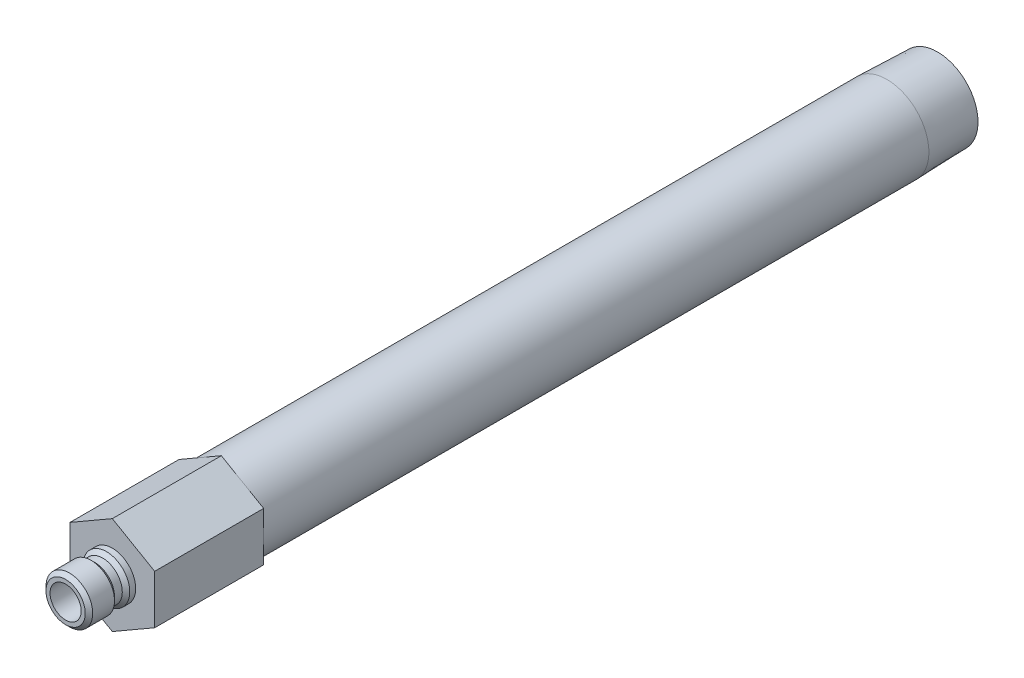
ISO-10303-21;
HEADER;
FILE_DESCRIPTION(('STEP AP214'),'2;1');
FILE_NAME('part.step','',(''),(''),'','','');
FILE_SCHEMA(('AUTOMOTIVE_DESIGN { 1 0 10303 214 1 1 1 1 }'));
ENDSEC;
DATA;
#1=APPLICATION_CONTEXT('core data for automotive mechanical design processes');
#2=APPLICATION_PROTOCOL_DEFINITION('international standard','automotive_design',2000,#1);
#3=PRODUCT_CONTEXT('',#1,'mechanical');
#4=PRODUCT('Part','Part','',(#3));
#5=PRODUCT_RELATED_PRODUCT_CATEGORY('part','',(#4));
#6=PRODUCT_DEFINITION_FORMATION('','',#4);
#7=PRODUCT_DEFINITION_CONTEXT('part definition',#1,'design');
#8=PRODUCT_DEFINITION('design','',#6,#7);
#9=PRODUCT_DEFINITION_SHAPE('','',#8);
#10=(LENGTH_UNIT() NAMED_UNIT(*) SI_UNIT(.MILLI.,.METRE.));
#11=(NAMED_UNIT(*) PLANE_ANGLE_UNIT() SI_UNIT($,.RADIAN.));
#12=(NAMED_UNIT(*) SI_UNIT($,.STERADIAN.) SOLID_ANGLE_UNIT());
#13=UNCERTAINTY_MEASURE_WITH_UNIT(LENGTH_MEASURE(1.E-05),#10,'distance_accuracy_value','');
#14=(GEOMETRIC_REPRESENTATION_CONTEXT(3) GLOBAL_UNCERTAINTY_ASSIGNED_CONTEXT((#13)) GLOBAL_UNIT_ASSIGNED_CONTEXT((#10,
#11,#12)) REPRESENTATION_CONTEXT('',''));
#15=CARTESIAN_POINT('',(0.,0.,0.));
#16=DIRECTION('',(0.,0.,1.));
#17=DIRECTION('',(1.,0.,0.));
#18=AXIS2_PLACEMENT_3D('',#15,#16,#17);
#19=CARTESIAN_POINT('',(0.,0.,0.));
#20=DIRECTION('',(0.,0.,-1.));
#21=DIRECTION('',(0.,1.,0.));
#22=AXIS2_PLACEMENT_3D('',#19,#20,#21);
#23=CYLINDRICAL_SURFACE('',#22,8.57249999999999);
#24=CARTESIAN_POINT('',(0.,0.,-157.9372));
#25=DIRECTION('',(0.,0.,-1.));
#26=DIRECTION('',(0.,1.,0.));
#27=AXIS2_PLACEMENT_3D('',#24,#25,#26);
#28=CIRCLE('',#27,8.57249999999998);
#29=CARTESIAN_POINT('',(0.,8.5725,-157.9372));
#30=VERTEX_POINT('',#29);
#31=EDGE_CURVE('E168',#30,#30,#28,.T.);
#32=ORIENTED_EDGE('',*,*,#31,.F.);
#33=EDGE_LOOP('',(#32));
#34=FACE_BOUND('',#33,.T.);
#35=CARTESIAN_POINT('',(0.,0.,-22.225));
#36=DIRECTION('',(0.,0.,1.));
#37=DIRECTION('',(1.,0.,0.));
#38=AXIS2_PLACEMENT_3D('',#35,#36,#37);
#39=CIRCLE('',#38,8.57249999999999);
#40=CARTESIAN_POINT('',(8.57249999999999,0.,-22.225));
#41=VERTEX_POINT('',#40);
#42=EDGE_CURVE('E37',#41,#41,#39,.F.);
#43=ORIENTED_EDGE('',*,*,#42,.T.);
#44=EDGE_LOOP('',(#43));
#45=FACE_BOUND('',#44,.T.);
#46=ADVANCED_FACE('F33',(#34,#45),#23,.T.);
#47=CARTESIAN_POINT('',(0.,0.,0.));
#48=DIRECTION('',(0.,0.,-1.));
#49=DIRECTION('',(0.,1.,0.));
#50=AXIS2_PLACEMENT_3D('',#47,#48,#49);
#51=CYLINDRICAL_SURFACE('',#50,3.175);
#52=CARTESIAN_POINT('',(0.,0.,9.525));
#53=DIRECTION('',(0.,0.,-1.));
#54=DIRECTION('',(0.,1.,0.));
#55=AXIS2_PLACEMENT_3D('',#52,#53,#54);
#56=CIRCLE('',#55,3.175);
#57=CARTESIAN_POINT('',(0.,3.175,9.525));
#58=VERTEX_POINT('',#57);
#59=EDGE_CURVE('E144',#58,#58,#56,.T.);
#60=ORIENTED_EDGE('',*,*,#59,.F.);
#61=EDGE_LOOP('',(#60));
#62=FACE_BOUND('',#61,.T.);
#63=CARTESIAN_POINT('',(0.,0.,-22.225));
#64=DIRECTION('',(0.,0.,-1.));
#65=DIRECTION('',(0.,1.,0.));
#66=AXIS2_PLACEMENT_3D('',#63,#64,#65);
#67=CIRCLE('',#66,3.17499999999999);
#68=CARTESIAN_POINT('',(0.,3.175,-22.225));
#69=VERTEX_POINT('',#68);
#70=EDGE_CURVE('E11',#69,#69,#67,.T.);
#71=ORIENTED_EDGE('',*,*,#70,.T.);
#72=EDGE_LOOP('',(#71));
#73=FACE_BOUND('',#72,.T.);
#74=ADVANCED_FACE('F35',(#62,#73),#51,.F.);
#75=CARTESIAN_POINT('',(0.,3.175,-22.225));
#76=DIRECTION('',(0.,0.,-1.));
#77=DIRECTION('',(0.,1.,0.));
#78=AXIS2_PLACEMENT_3D('',#75,#76,#77);
#79=PLANE('',#78);
#80=CARTESIAN_POINT('',(0.,0.,-22.225));
#81=DIRECTION('',(0.,0.,-1.));
#82=DIRECTION('',(0.,1.,0.));
#83=AXIS2_PLACEMENT_3D('',#80,#81,#82);
#84=CIRCLE('',#83,6.2611);
#85=CARTESIAN_POINT('',(0.,6.2611,-22.225));
#86=VERTEX_POINT('',#85);
#87=EDGE_CURVE('E43',#86,#86,#84,.T.);
#88=ORIENTED_EDGE('',*,*,#87,.T.);
#89=EDGE_LOOP('',(#88));
#90=FACE_BOUND('',#89,.T.);
#91=ORIENTED_EDGE('',*,*,#70,.F.);
#92=EDGE_LOOP('',(#91));
#93=FACE_BOUND('',#92,.T.);
#94=ADVANCED_FACE('F180',(#90,#93),#79,.T.);
#95=CARTESIAN_POINT('',(0.,0.,0.));
#96=DIRECTION('',(0.,0.,-1.));
#97=DIRECTION('',(0.,1.,0.));
#98=AXIS2_PLACEMENT_3D('',#95,#96,#97);
#99=CYLINDRICAL_SURFACE('',#98,6.26109999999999);
#100=CARTESIAN_POINT('',(0.,0.,-168.275));
#101=DIRECTION('',(0.,0.,-1.));
#102=DIRECTION('',(0.,1.,0.));
#103=AXIS2_PLACEMENT_3D('',#100,#101,#102);
#104=CIRCLE('',#103,6.26109999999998);
#105=CARTESIAN_POINT('',(0.,6.2611,-168.275));
#106=VERTEX_POINT('',#105);
#107=EDGE_CURVE('E174',#106,#106,#104,.T.);
#108=ORIENTED_EDGE('',*,*,#107,.T.);
#109=EDGE_LOOP('',(#108));
#110=FACE_BOUND('',#109,.T.);
#111=ORIENTED_EDGE('',*,*,#87,.F.);
#112=EDGE_LOOP('',(#111));
#113=FACE_BOUND('',#112,.T.);
#114=ADVANCED_FACE('F183',(#110,#113),#99,.F.);
#115=CARTESIAN_POINT('',(0.,8.24944566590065,-168.275));
#116=DIRECTION('',(0.,0.,-1.));
#117=DIRECTION('',(0.,1.,0.));
#118=AXIS2_PLACEMENT_3D('',#115,#116,#117);
#119=PLANE('',#118);
#120=CARTESIAN_POINT('',(0.,0.,-168.275));
#121=DIRECTION('',(0.,0.,-1.));
#122=DIRECTION('',(0.,1.,0.));
#123=AXIS2_PLACEMENT_3D('',#120,#121,#122);
#124=CIRCLE('',#123,8.24944566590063);
#125=CARTESIAN_POINT('',(0.,8.24944566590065,-168.275));
#126=VERTEX_POINT('',#125);
#127=EDGE_CURVE('E171',#126,#126,#124,.T.);
#128=ORIENTED_EDGE('',*,*,#127,.T.);
#129=EDGE_LOOP('',(#128));
#130=FACE_BOUND('',#129,.T.);
#131=ORIENTED_EDGE('',*,*,#107,.F.);
#132=EDGE_LOOP('',(#131));
#133=FACE_BOUND('',#132,.T.);
#134=ADVANCED_FACE('F185',(#130,#133),#119,.T.);
#135=CARTESIAN_POINT('',(0.,0.,-168.275));
#136=DIRECTION('',(0.,0.,1.));
#137=DIRECTION('',(0.,-1.,0.));
#138=AXIS2_PLACEMENT_3D('',#135,#136,#137);
#139=CONICAL_SURFACE('',#138,8.24944566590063,0.0312396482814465);
#140=ORIENTED_EDGE('',*,*,#31,.T.);
#141=EDGE_LOOP('',(#140));
#142=FACE_BOUND('',#141,.T.);
#143=ORIENTED_EDGE('',*,*,#127,.F.);
#144=EDGE_LOOP('',(#143));
#145=FACE_BOUND('',#144,.T.);
#146=ADVANCED_FACE('F192',(#142,#145),#139,.T.);
#147=CARTESIAN_POINT('',(0.,4.7625,0.));
#148=DIRECTION('',(0.,0.,1.));
#149=DIRECTION('',(0.,-1.,0.));
#150=AXIS2_PLACEMENT_3D('',#147,#148,#149);
#151=PLANE('',#150);
#152=CARTESIAN_POINT('',(0.,0.,0.));
#153=DIRECTION('',(0.,0.,-1.));
#154=DIRECTION('',(0.,1.,0.));
#155=AXIS2_PLACEMENT_3D('',#152,#153,#154);
#156=CIRCLE('',#155,4.7625);
#157=CARTESIAN_POINT('',(0.,4.7625,0.));
#158=VERTEX_POINT('',#157);
#159=EDGE_CURVE('E165',#158,#158,#156,.T.);
#160=ORIENTED_EDGE('',*,*,#159,.T.);
#161=EDGE_LOOP('',(#160));
#162=FACE_BOUND('',#161,.T.);
#163=DIRECTION('',(-0.866025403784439,-0.5,0.));
#164=VECTOR('',#163,1.);
#165=CARTESIAN_POINT('',(0.,9.97199384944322,0.));
#166=LINE('',#165,#164);
#167=CARTESIAN_POINT('',(0.,9.97199384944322,0.));
#168=VERTEX_POINT('',#167);
#169=CARTESIAN_POINT('',(-8.636,4.98599692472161,0.));
#170=VERTEX_POINT('',#169);
#171=EDGE_CURVE('E122',#168,#170,#166,.T.);
#172=ORIENTED_EDGE('',*,*,#171,.T.);
#173=DIRECTION('',(0.,-1.,0.));
#174=VECTOR('',#173,1.);
#175=CARTESIAN_POINT('',(-8.636,4.98599692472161,0.));
#176=LINE('',#175,#174);
#177=CARTESIAN_POINT('',(-8.636,-4.98599692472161,0.));
#178=VERTEX_POINT('',#177);
#179=EDGE_CURVE('E125',#170,#178,#176,.T.);
#180=ORIENTED_EDGE('',*,*,#179,.T.);
#181=DIRECTION('',(0.866025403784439,-0.5,0.));
#182=VECTOR('',#181,1.);
#183=CARTESIAN_POINT('',(-8.636,-4.98599692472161,0.));
#184=LINE('',#183,#182);
#185=CARTESIAN_POINT('',(0.,-9.97199384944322,0.));
#186=VERTEX_POINT('',#185);
#187=EDGE_CURVE('E128',#178,#186,#184,.T.);
#188=ORIENTED_EDGE('',*,*,#187,.T.);
#189=DIRECTION('',(0.866025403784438,0.5,0.));
#190=VECTOR('',#189,1.);
#191=CARTESIAN_POINT('',(0.,-9.97199384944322,0.));
#192=LINE('',#191,#190);
#193=CARTESIAN_POINT('',(8.636,-4.98599692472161,0.));
#194=VERTEX_POINT('',#193);
#195=EDGE_CURVE('E131',#186,#194,#192,.T.);
#196=ORIENTED_EDGE('',*,*,#195,.T.);
#197=DIRECTION('',(0.,1.,0.));
#198=VECTOR('',#197,1.);
#199=CARTESIAN_POINT('',(8.636,-4.98599692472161,0.));
#200=LINE('',#199,#198);
#201=CARTESIAN_POINT('',(8.636,4.98599692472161,0.));
#202=VERTEX_POINT('',#201);
#203=EDGE_CURVE('E99',#194,#202,#200,.T.);
#204=ORIENTED_EDGE('',*,*,#203,.T.);
#205=DIRECTION('',(-0.866025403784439,0.5,0.));
#206=VECTOR('',#205,1.);
#207=CARTESIAN_POINT('',(8.636,4.98599692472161,0.));
#208=LINE('',#207,#206);
#209=EDGE_CURVE('E134',#202,#168,#208,.T.);
#210=ORIENTED_EDGE('',*,*,#209,.T.);
#211=EDGE_LOOP('',(#172,#180,#188,#196,#204,#210));
#212=FACE_BOUND('',#211,.T.);
#213=ADVANCED_FACE('F206',(#162,#212),#151,.T.);
#214=CARTESIAN_POINT('',(0.,0.,0.));
#215=DIRECTION('',(0.,0.,-1.));
#216=DIRECTION('',(0.,1.,0.));
#217=AXIS2_PLACEMENT_3D('',#214,#215,#216);
#218=CYLINDRICAL_SURFACE('',#217,4.7625);
#219=CARTESIAN_POINT('',(0.,0.,1.2065));
#220=DIRECTION('',(0.,0.,-1.));
#221=DIRECTION('',(0.,1.,0.));
#222=AXIS2_PLACEMENT_3D('',#219,#220,#221);
#223=CIRCLE('',#222,4.7625);
#224=CARTESIAN_POINT('',(0.,4.7625,1.2065));
#225=VERTEX_POINT('',#224);
#226=EDGE_CURVE('E162',#225,#225,#223,.T.);
#227=ORIENTED_EDGE('',*,*,#226,.T.);
#228=EDGE_LOOP('',(#227));
#229=FACE_BOUND('',#228,.T.);
#230=ORIENTED_EDGE('',*,*,#159,.F.);
#231=EDGE_LOOP('',(#230));
#232=FACE_BOUND('',#231,.T.);
#233=ADVANCED_FACE('F213',(#229,#232),#218,.T.);
#234=CARTESIAN_POINT('',(0.,0.,1.2065));
#235=DIRECTION('',(0.,0.,-1.));
#236=DIRECTION('',(0.,1.,0.));
#237=AXIS2_PLACEMENT_3D('',#234,#235,#236);
#238=CONICAL_SURFACE('',#237,4.7625,0.785398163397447);
#239=CARTESIAN_POINT('',(0.,0.,1.9685));
#240=DIRECTION('',(0.,0.,-1.));
#241=DIRECTION('',(0.,1.,0.));
#242=AXIS2_PLACEMENT_3D('',#239,#240,#241);
#243=CIRCLE('',#242,4.0005);
#244=CARTESIAN_POINT('',(0.,4.0005,1.9685));
#245=VERTEX_POINT('',#244);
#246=EDGE_CURVE('E159',#245,#245,#243,.T.);
#247=ORIENTED_EDGE('',*,*,#246,.T.);
#248=EDGE_LOOP('',(#247));
#249=FACE_BOUND('',#248,.T.);
#250=ORIENTED_EDGE('',*,*,#226,.F.);
#251=EDGE_LOOP('',(#250));
#252=FACE_BOUND('',#251,.T.);
#253=ADVANCED_FACE('F222',(#249,#252),#238,.T.);
#254=CARTESIAN_POINT('',(0.,0.,0.));
#255=DIRECTION('',(0.,0.,-1.));
#256=DIRECTION('',(0.,1.,0.));
#257=AXIS2_PLACEMENT_3D('',#254,#255,#256);
#258=CYLINDRICAL_SURFACE('',#257,4.0005);
#259=CARTESIAN_POINT('',(0.,0.,3.556));
#260=DIRECTION('',(0.,0.,-1.));
#261=DIRECTION('',(0.,1.,0.));
#262=AXIS2_PLACEMENT_3D('',#259,#260,#261);
#263=CIRCLE('',#262,4.0005);
#264=CARTESIAN_POINT('',(0.,4.0005,3.556));
#265=VERTEX_POINT('',#264);
#266=EDGE_CURVE('E156',#265,#265,#263,.T.);
#267=ORIENTED_EDGE('',*,*,#266,.T.);
#268=EDGE_LOOP('',(#267));
#269=FACE_BOUND('',#268,.T.);
#270=ORIENTED_EDGE('',*,*,#246,.F.);
#271=EDGE_LOOP('',(#270));
#272=FACE_BOUND('',#271,.T.);
#273=ADVANCED_FACE('F263',(#269,#272),#258,.T.);
#274=CARTESIAN_POINT('',(0.,0.,3.556));
#275=DIRECTION('',(0.,0.,1.));
#276=DIRECTION('',(0.,-1.,0.));
#277=AXIS2_PLACEMENT_3D('',#274,#275,#276);
#278=CONICAL_SURFACE('',#277,4.0005,0.785398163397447);
#279=CARTESIAN_POINT('',(0.,0.,4.318));
#280=DIRECTION('',(0.,0.,-1.));
#281=DIRECTION('',(0.,1.,0.));
#282=AXIS2_PLACEMENT_3D('',#279,#280,#281);
#283=CIRCLE('',#282,4.7625);
#284=CARTESIAN_POINT('',(0.,4.7625,4.318));
#285=VERTEX_POINT('',#284);
#286=EDGE_CURVE('E153',#285,#285,#283,.T.);
#287=ORIENTED_EDGE('',*,*,#286,.T.);
#288=EDGE_LOOP('',(#287));
#289=FACE_BOUND('',#288,.T.);
#290=ORIENTED_EDGE('',*,*,#266,.F.);
#291=EDGE_LOOP('',(#290));
#292=FACE_BOUND('',#291,.T.);
#293=ADVANCED_FACE('F259',(#289,#292),#278,.T.);
#294=CARTESIAN_POINT('',(0.,0.,0.));
#295=DIRECTION('',(0.,0.,-1.));
#296=DIRECTION('',(0.,1.,0.));
#297=AXIS2_PLACEMENT_3D('',#294,#295,#296);
#298=CYLINDRICAL_SURFACE('',#297,4.7625);
#299=CARTESIAN_POINT('',(0.,0.,8.763));
#300=DIRECTION('',(0.,0.,-1.));
#301=DIRECTION('',(0.,1.,0.));
#302=AXIS2_PLACEMENT_3D('',#299,#300,#301);
#303=CIRCLE('',#302,4.7625);
#304=CARTESIAN_POINT('',(0.,4.7625,8.763));
#305=VERTEX_POINT('',#304);
#306=EDGE_CURVE('E150',#305,#305,#303,.T.);
#307=ORIENTED_EDGE('',*,*,#306,.T.);
#308=EDGE_LOOP('',(#307));
#309=FACE_BOUND('',#308,.T.);
#310=ORIENTED_EDGE('',*,*,#286,.F.);
#311=EDGE_LOOP('',(#310));
#312=FACE_BOUND('',#311,.T.);
#313=ADVANCED_FACE('F255',(#309,#312),#298,.T.);
#314=CARTESIAN_POINT('',(0.,0.,8.763));
#315=DIRECTION('',(0.,0.,-1.));
#316=DIRECTION('',(0.,1.,0.));
#317=AXIS2_PLACEMENT_3D('',#314,#315,#316);
#318=CONICAL_SURFACE('',#317,4.7625,0.785398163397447);
#319=CARTESIAN_POINT('',(0.,0.,9.525));
#320=DIRECTION('',(0.,0.,-1.));
#321=DIRECTION('',(0.,1.,0.));
#322=AXIS2_PLACEMENT_3D('',#319,#320,#321);
#323=CIRCLE('',#322,4.0005);
#324=CARTESIAN_POINT('',(0.,4.0005,9.525));
#325=VERTEX_POINT('',#324);
#326=EDGE_CURVE('E147',#325,#325,#323,.T.);
#327=ORIENTED_EDGE('',*,*,#326,.T.);
#328=EDGE_LOOP('',(#327));
#329=FACE_BOUND('',#328,.T.);
#330=ORIENTED_EDGE('',*,*,#306,.F.);
#331=EDGE_LOOP('',(#330));
#332=FACE_BOUND('',#331,.T.);
#333=ADVANCED_FACE('F251',(#329,#332),#318,.T.);
#334=CARTESIAN_POINT('',(0.,3.175,9.525));
#335=DIRECTION('',(0.,0.,1.));
#336=DIRECTION('',(0.,-1.,0.));
#337=AXIS2_PLACEMENT_3D('',#334,#335,#336);
#338=PLANE('',#337);
#339=ORIENTED_EDGE('',*,*,#59,.T.);
#340=EDGE_LOOP('',(#339));
#341=FACE_BOUND('',#340,.T.);
#342=ORIENTED_EDGE('',*,*,#326,.F.);
#343=EDGE_LOOP('',(#342));
#344=FACE_BOUND('',#343,.T.);
#345=ADVANCED_FACE('F239',(#341,#344),#338,.T.);
#346=CARTESIAN_POINT('',(0.,9.97199384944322,-22.225));
#347=DIRECTION('',(-0.5,0.866025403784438,0.));
#348=DIRECTION('',(-0.866025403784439,-0.5,0.));
#349=AXIS2_PLACEMENT_3D('',#346,#347,#348);
#350=PLANE('',#349);
#351=ORIENTED_EDGE('',*,*,#171,.F.);
#352=DIRECTION('',(0.,0.,1.));
#353=VECTOR('',#352,1.);
#354=CARTESIAN_POINT('',(0.,9.97199384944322,-22.225));
#355=LINE('',#354,#353);
#356=CARTESIAN_POINT('',(0.,9.97199384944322,-22.225));
#357=VERTEX_POINT('',#356);
#358=EDGE_CURVE('E51',#357,#168,#355,.T.);
#359=ORIENTED_EDGE('',*,*,#358,.F.);
#360=DIRECTION('',(-0.866025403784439,-0.5,0.));
#361=VECTOR('',#360,1.);
#362=CARTESIAN_POINT('',(0.,9.97199384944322,-22.225));
#363=LINE('',#362,#361);
#364=CARTESIAN_POINT('',(-8.636,4.98599692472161,-22.225));
#365=VERTEX_POINT('',#364);
#366=EDGE_CURVE('E137',#357,#365,#363,.T.);
#367=ORIENTED_EDGE('',*,*,#366,.T.);
#368=DIRECTION('',(0.,0.,1.));
#369=VECTOR('',#368,1.);
#370=CARTESIAN_POINT('',(-8.636,4.98599692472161,-22.225));
#371=LINE('',#370,#369);
#372=EDGE_CURVE('E86',#365,#170,#371,.T.);
#373=ORIENTED_EDGE('',*,*,#372,.T.);
#374=EDGE_LOOP('',(#351,#359,#367,#373));
#375=FACE_BOUND('',#374,.T.);
#376=ADVANCED_FACE('F226',(#375),#350,.T.);
#377=CARTESIAN_POINT('',(8.636,4.98599692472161,-22.225));
#378=DIRECTION('',(0.5,0.866025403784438,0.));
#379=DIRECTION('',(-0.866025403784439,0.5,0.));
#380=AXIS2_PLACEMENT_3D('',#377,#378,#379);
#381=PLANE('',#380);
#382=ORIENTED_EDGE('',*,*,#209,.F.);
#383=DIRECTION('',(0.,0.,1.));
#384=VECTOR('',#383,1.);
#385=CARTESIAN_POINT('',(8.636,4.98599692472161,-22.225));
#386=LINE('',#385,#384);
#387=CARTESIAN_POINT('',(8.636,4.98599692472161,-22.225));
#388=VERTEX_POINT('',#387);
#389=EDGE_CURVE('E74',#388,#202,#386,.T.);
#390=ORIENTED_EDGE('',*,*,#389,.F.);
#391=DIRECTION('',(-0.866025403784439,0.5,0.));
#392=VECTOR('',#391,1.);
#393=CARTESIAN_POINT('',(8.636,4.98599692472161,-22.225));
#394=LINE('',#393,#392);
#395=EDGE_CURVE('E112',#388,#357,#394,.T.);
#396=ORIENTED_EDGE('',*,*,#395,.T.);
#397=ORIENTED_EDGE('',*,*,#358,.T.);
#398=EDGE_LOOP('',(#382,#390,#396,#397));
#399=FACE_BOUND('',#398,.T.);
#400=ADVANCED_FACE('F231',(#399),#381,.T.);
#401=CARTESIAN_POINT('',(8.636,-4.98599692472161,-22.225));
#402=DIRECTION('',(1.,0.,0.));
#403=DIRECTION('',(0.,1.,0.));
#404=AXIS2_PLACEMENT_3D('',#401,#402,#403);
#405=PLANE('',#404);
#406=ORIENTED_EDGE('',*,*,#203,.F.);
#407=DIRECTION('',(0.,0.,1.));
#408=VECTOR('',#407,1.);
#409=CARTESIAN_POINT('',(8.636,-4.98599692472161,-22.225));
#410=LINE('',#409,#408);
#411=CARTESIAN_POINT('',(8.636,-4.98599692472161,-22.225));
#412=VERTEX_POINT('',#411);
#413=EDGE_CURVE('E94',#412,#194,#410,.T.);
#414=ORIENTED_EDGE('',*,*,#413,.F.);
#415=DIRECTION('',(0.,1.,0.));
#416=VECTOR('',#415,1.);
#417=CARTESIAN_POINT('',(8.636,-4.98599692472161,-22.225));
#418=LINE('',#417,#416);
#419=EDGE_CURVE('E97',#412,#388,#418,.T.);
#420=ORIENTED_EDGE('',*,*,#419,.T.);
#421=ORIENTED_EDGE('',*,*,#389,.T.);
#422=EDGE_LOOP('',(#406,#414,#420,#421));
#423=FACE_BOUND('',#422,.T.);
#424=ADVANCED_FACE('F96',(#423),#405,.T.);
#425=CARTESIAN_POINT('',(0.,-9.97199384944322,-22.225));
#426=DIRECTION('',(0.5,-0.866025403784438,0.));
#427=DIRECTION('',(0.866025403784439,0.5,0.));
#428=AXIS2_PLACEMENT_3D('',#425,#426,#427);
#429=PLANE('',#428);
#430=ORIENTED_EDGE('',*,*,#195,.F.);
#431=DIRECTION('',(0.,0.,1.));
#432=VECTOR('',#431,1.);
#433=CARTESIAN_POINT('',(0.,-9.97199384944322,-22.225));
#434=LINE('',#433,#432);
#435=CARTESIAN_POINT('',(0.,-9.97199384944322,-22.225));
#436=VERTEX_POINT('',#435);
#437=EDGE_CURVE('E104',#436,#186,#434,.T.);
#438=ORIENTED_EDGE('',*,*,#437,.F.);
#439=DIRECTION('',(0.866025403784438,0.5,0.));
#440=VECTOR('',#439,1.);
#441=CARTESIAN_POINT('',(0.,-9.97199384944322,-22.225));
#442=LINE('',#441,#440);
#443=EDGE_CURVE('E110',#436,#412,#442,.T.);
#444=ORIENTED_EDGE('',*,*,#443,.T.);
#445=ORIENTED_EDGE('',*,*,#413,.T.);
#446=EDGE_LOOP('',(#430,#438,#444,#445));
#447=FACE_BOUND('',#446,.T.);
#448=ADVANCED_FACE('F114',(#447),#429,.T.);
#449=CARTESIAN_POINT('',(-8.636,-4.98599692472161,-22.225));
#450=DIRECTION('',(-0.5,-0.866025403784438,0.));
#451=DIRECTION('',(0.866025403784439,-0.5,0.));
#452=AXIS2_PLACEMENT_3D('',#449,#450,#451);
#453=PLANE('',#452);
#454=ORIENTED_EDGE('',*,*,#187,.F.);
#455=DIRECTION('',(0.,0.,1.));
#456=VECTOR('',#455,1.);
#457=CARTESIAN_POINT('',(-8.636,-4.98599692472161,-22.225));
#458=LINE('',#457,#456);
#459=CARTESIAN_POINT('',(-8.636,-4.98599692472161,-22.225));
#460=VERTEX_POINT('',#459);
#461=EDGE_CURVE('E141',#460,#178,#458,.T.);
#462=ORIENTED_EDGE('',*,*,#461,.F.);
#463=DIRECTION('',(0.866025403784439,-0.5,0.));
#464=VECTOR('',#463,1.);
#465=CARTESIAN_POINT('',(-8.636,-4.98599692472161,-22.225));
#466=LINE('',#465,#464);
#467=EDGE_CURVE('E115',#460,#436,#466,.T.);
#468=ORIENTED_EDGE('',*,*,#467,.T.);
#469=ORIENTED_EDGE('',*,*,#437,.T.);
#470=EDGE_LOOP('',(#454,#462,#468,#469));
#471=FACE_BOUND('',#470,.T.);
#472=ADVANCED_FACE('F230',(#471),#453,.T.);
#473=CARTESIAN_POINT('',(-8.636,4.98599692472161,-22.225));
#474=DIRECTION('',(-1.,0.,0.));
#475=DIRECTION('',(0.,0.,1.));
#476=AXIS2_PLACEMENT_3D('',#473,#474,#475);
#477=PLANE('',#476);
#478=ORIENTED_EDGE('',*,*,#179,.F.);
#479=ORIENTED_EDGE('',*,*,#372,.F.);
#480=DIRECTION('',(0.,-1.,0.));
#481=VECTOR('',#480,1.);
#482=CARTESIAN_POINT('',(-8.636,4.98599692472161,-22.225));
#483=LINE('',#482,#481);
#484=EDGE_CURVE('E117',#365,#460,#483,.T.);
#485=ORIENTED_EDGE('',*,*,#484,.T.);
#486=ORIENTED_EDGE('',*,*,#461,.T.);
#487=EDGE_LOOP('',(#478,#479,#485,#486));
#488=FACE_BOUND('',#487,.T.);
#489=ADVANCED_FACE('F227',(#488),#477,.T.);
#490=CARTESIAN_POINT('',(-8.636,4.98599692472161,-22.225));
#491=DIRECTION('',(0.,0.,1.));
#492=DIRECTION('',(1.,0.,0.));
#493=AXIS2_PLACEMENT_3D('',#490,#491,#492);
#494=PLANE('',#493);
#495=ORIENTED_EDGE('',*,*,#42,.F.);
#496=EDGE_LOOP('',(#495));
#497=FACE_BOUND('',#496,.T.);
#498=ORIENTED_EDGE('',*,*,#366,.F.);
#499=ORIENTED_EDGE('',*,*,#395,.F.);
#500=ORIENTED_EDGE('',*,*,#419,.F.);
#501=ORIENTED_EDGE('',*,*,#443,.F.);
#502=ORIENTED_EDGE('',*,*,#467,.F.);
#503=ORIENTED_EDGE('',*,*,#484,.F.);
#504=EDGE_LOOP('',(#498,#499,#500,#501,#502,#503));
#505=FACE_BOUND('',#504,.T.);
#506=ADVANCED_FACE('F108',(#497,#505),#494,.F.);
#507=CLOSED_SHELL('',(#46,#74,#94,#114,#134,#146,#213,#233,#253,#273,#293,#313,#333,#345,#376,
#400,#424,#448,#472,#489,#506));
#508=MANIFOLD_SOLID_BREP('B2',#507);
#509=ADVANCED_BREP_SHAPE_REPRESENTATION('',(#18,#508),#14);
#510=SHAPE_DEFINITION_REPRESENTATION(#9,#509);
ENDSEC;
END-ISO-10303-21;
